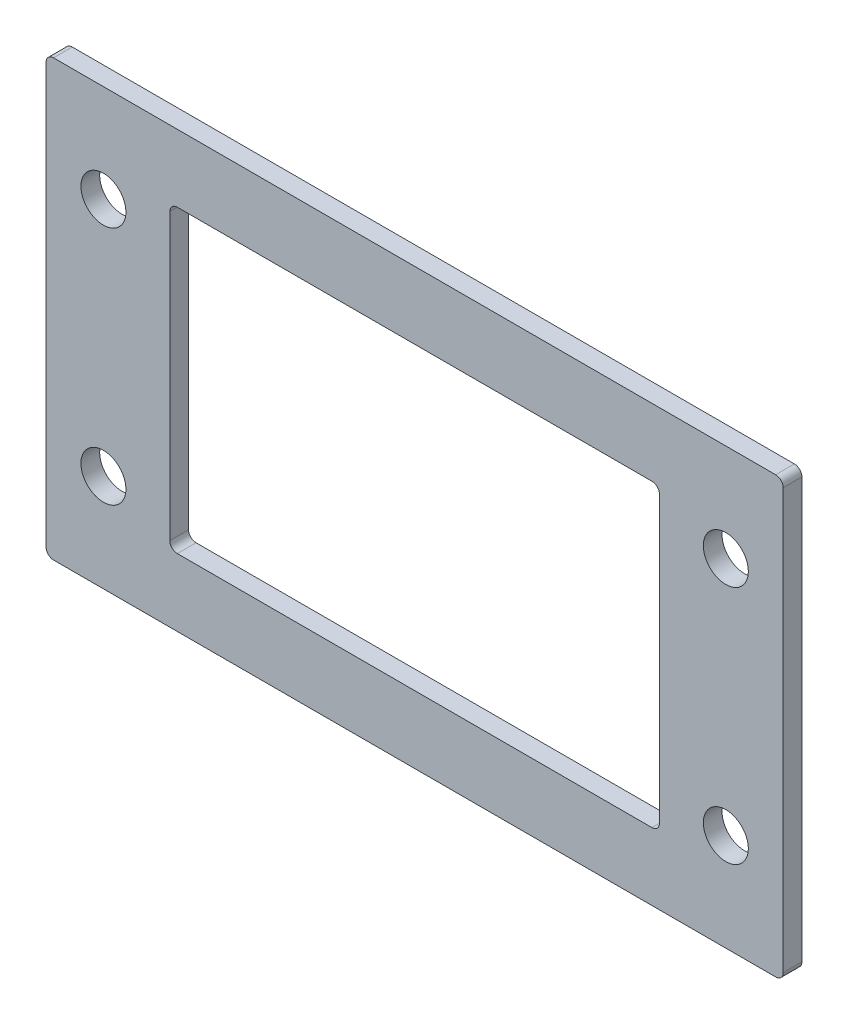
ISO-10303-21;
HEADER;
FILE_DESCRIPTION(('STEP AP214'),'2;1');
FILE_NAME('part.step','',(''),(''),'','','');
FILE_SCHEMA(('AUTOMOTIVE_DESIGN { 1 0 10303 214 1 1 1 1 }'));
ENDSEC;
DATA;
#1=APPLICATION_CONTEXT('core data for automotive mechanical design processes');
#2=APPLICATION_PROTOCOL_DEFINITION('international standard','automotive_design',2000,#1);
#3=PRODUCT_CONTEXT('',#1,'mechanical');
#4=PRODUCT('Part','Part','',(#3));
#5=PRODUCT_RELATED_PRODUCT_CATEGORY('part','',(#4));
#6=PRODUCT_DEFINITION_FORMATION('','',#4);
#7=PRODUCT_DEFINITION_CONTEXT('part definition',#1,'design');
#8=PRODUCT_DEFINITION('design','',#6,#7);
#9=PRODUCT_DEFINITION_SHAPE('','',#8);
#10=(LENGTH_UNIT() NAMED_UNIT(*) SI_UNIT(.MILLI.,.METRE.));
#11=(NAMED_UNIT(*) PLANE_ANGLE_UNIT() SI_UNIT($,.RADIAN.));
#12=(NAMED_UNIT(*) SI_UNIT($,.STERADIAN.) SOLID_ANGLE_UNIT());
#13=UNCERTAINTY_MEASURE_WITH_UNIT(LENGTH_MEASURE(1.E-05),#10,'distance_accuracy_value','');
#14=(GEOMETRIC_REPRESENTATION_CONTEXT(3) GLOBAL_UNCERTAINTY_ASSIGNED_CONTEXT((#13)) GLOBAL_UNIT_ASSIGNED_CONTEXT((#10,
#11,#12)) REPRESENTATION_CONTEXT('',''));
#15=CARTESIAN_POINT('',(0.,0.,0.));
#16=DIRECTION('',(0.,0.,1.));
#17=DIRECTION('',(1.,0.,0.));
#18=AXIS2_PLACEMENT_3D('',#15,#16,#17);
#19=CARTESIAN_POINT('',(-48.15,28.,-17.05));
#20=DIRECTION('',(0.,0.,-1.));
#21=DIRECTION('',(0.,1.,0.));
#22=AXIS2_PLACEMENT_3D('',#19,#20,#21);
#23=CYLINDRICAL_SURFACE('',#22,1.);
#24=CARTESIAN_POINT('',(-48.15,28.,-17.05));
#25=DIRECTION('',(0.,0.,1.));
#26=DIRECTION('',(0.,-1.,0.));
#27=AXIS2_PLACEMENT_3D('',#24,#25,#26);
#28=CIRCLE('',#27,1.);
#29=CARTESIAN_POINT('',(-48.15,29.,-17.05));
#30=VERTEX_POINT('',#29);
#31=CARTESIAN_POINT('',(-49.15,28.,-17.05));
#32=VERTEX_POINT('',#31);
#33=EDGE_CURVE('E393',#30,#32,#28,.T.);
#34=ORIENTED_EDGE('',*,*,#33,.F.);
#35=DIRECTION('',(0.,0.,1.));
#36=VECTOR('',#35,1.);
#37=CARTESIAN_POINT('',(-48.15,29.,-17.05));
#38=LINE('',#37,#36);
#39=CARTESIAN_POINT('',(-48.15,29.,-19.55));
#40=VERTEX_POINT('',#39);
#41=EDGE_CURVE('E248',#40,#30,#38,.T.);
#42=ORIENTED_EDGE('',*,*,#41,.F.);
#43=CARTESIAN_POINT('',(-48.15,28.,-19.55));
#44=DIRECTION('',(0.,0.,-1.));
#45=DIRECTION('',(0.,-1.,0.));
#46=AXIS2_PLACEMENT_3D('',#43,#44,#45);
#47=CIRCLE('',#46,1.);
#48=CARTESIAN_POINT('',(-49.15,28.,-19.55));
#49=VERTEX_POINT('',#48);
#50=EDGE_CURVE('E307',#49,#40,#47,.T.);
#51=ORIENTED_EDGE('',*,*,#50,.F.);
#52=DIRECTION('',(0.,0.,-1.));
#53=VECTOR('',#52,1.);
#54=CARTESIAN_POINT('',(-49.15,28.,-17.05));
#55=LINE('',#54,#53);
#56=EDGE_CURVE('E234',#32,#49,#55,.T.);
#57=ORIENTED_EDGE('',*,*,#56,.F.);
#58=EDGE_LOOP('',(#34,#42,#51,#57));
#59=FACE_BOUND('',#58,.T.);
#60=ADVANCED_FACE('F15',(#59),#23,.T.);
#61=CARTESIAN_POINT('',(-48.15,-28.,-17.05));
#62=DIRECTION('',(0.,0.,-1.));
#63=DIRECTION('',(0.,1.,0.));
#64=AXIS2_PLACEMENT_3D('',#61,#62,#63);
#65=CYLINDRICAL_SURFACE('',#64,1.);
#66=CARTESIAN_POINT('',(-48.15,-28.,-17.05));
#67=DIRECTION('',(0.,0.,1.));
#68=DIRECTION('',(0.,-1.,0.));
#69=AXIS2_PLACEMENT_3D('',#66,#67,#68);
#70=CIRCLE('',#69,1.);
#71=CARTESIAN_POINT('',(-49.15,-28.,-17.05));
#72=VERTEX_POINT('',#71);
#73=CARTESIAN_POINT('',(-48.15,-29.,-17.05));
#74=VERTEX_POINT('',#73);
#75=EDGE_CURVE('E407',#72,#74,#70,.T.);
#76=ORIENTED_EDGE('',*,*,#75,.F.);
#77=DIRECTION('',(0.,0.,1.));
#78=VECTOR('',#77,1.);
#79=CARTESIAN_POINT('',(-49.15,-28.,-17.05));
#80=LINE('',#79,#78);
#81=CARTESIAN_POINT('',(-49.15,-28.,-19.55));
#82=VERTEX_POINT('',#81);
#83=EDGE_CURVE('E212',#82,#72,#80,.T.);
#84=ORIENTED_EDGE('',*,*,#83,.F.);
#85=CARTESIAN_POINT('',(-48.15,-28.,-19.55));
#86=DIRECTION('',(0.,0.,-1.));
#87=DIRECTION('',(0.,-1.,0.));
#88=AXIS2_PLACEMENT_3D('',#85,#86,#87);
#89=CIRCLE('',#88,1.);
#90=CARTESIAN_POINT('',(-48.15,-29.,-19.55));
#91=VERTEX_POINT('',#90);
#92=EDGE_CURVE('E299',#91,#82,#89,.T.);
#93=ORIENTED_EDGE('',*,*,#92,.F.);
#94=DIRECTION('',(0.,0.,-1.));
#95=VECTOR('',#94,1.);
#96=CARTESIAN_POINT('',(-48.15,-29.,-17.05));
#97=LINE('',#96,#95);
#98=EDGE_CURVE('E240',#74,#91,#97,.T.);
#99=ORIENTED_EDGE('',*,*,#98,.F.);
#100=EDGE_LOOP('',(#76,#84,#93,#99));
#101=FACE_BOUND('',#100,.T.);
#102=ADVANCED_FACE('F475',(#101),#65,.T.);
#103=CARTESIAN_POINT('',(48.15,28.,-17.05));
#104=DIRECTION('',(0.,0.,-1.));
#105=DIRECTION('',(0.,1.,0.));
#106=AXIS2_PLACEMENT_3D('',#103,#104,#105);
#107=CYLINDRICAL_SURFACE('',#106,1.);
#108=CARTESIAN_POINT('',(48.15,28.,-17.05));
#109=DIRECTION('',(0.,0.,1.));
#110=DIRECTION('',(0.,-1.,0.));
#111=AXIS2_PLACEMENT_3D('',#108,#109,#110);
#112=CIRCLE('',#111,1.);
#113=CARTESIAN_POINT('',(49.15,28.,-17.05));
#114=VERTEX_POINT('',#113);
#115=CARTESIAN_POINT('',(48.15,29.,-17.05));
#116=VERTEX_POINT('',#115);
#117=EDGE_CURVE('E411',#114,#116,#112,.T.);
#118=ORIENTED_EDGE('',*,*,#117,.F.);
#119=DIRECTION('',(0.,0.,1.));
#120=VECTOR('',#119,1.);
#121=CARTESIAN_POINT('',(49.15,28.,-17.05));
#122=LINE('',#121,#120);
#123=CARTESIAN_POINT('',(49.15,28.,-19.55));
#124=VERTEX_POINT('',#123);
#125=EDGE_CURVE('E244',#124,#114,#122,.T.);
#126=ORIENTED_EDGE('',*,*,#125,.F.);
#127=CARTESIAN_POINT('',(48.15,28.,-19.55));
#128=DIRECTION('',(0.,0.,-1.));
#129=DIRECTION('',(0.,-1.,0.));
#130=AXIS2_PLACEMENT_3D('',#127,#128,#129);
#131=CIRCLE('',#130,1.);
#132=CARTESIAN_POINT('',(48.15,29.,-19.55));
#133=VERTEX_POINT('',#132);
#134=EDGE_CURVE('E315',#133,#124,#131,.T.);
#135=ORIENTED_EDGE('',*,*,#134,.F.);
#136=DIRECTION('',(0.,0.,-1.));
#137=VECTOR('',#136,1.);
#138=CARTESIAN_POINT('',(48.15,29.,-17.05));
#139=LINE('',#138,#137);
#140=EDGE_CURVE('E247',#116,#133,#139,.T.);
#141=ORIENTED_EDGE('',*,*,#140,.F.);
#142=EDGE_LOOP('',(#118,#126,#135,#141));
#143=FACE_BOUND('',#142,.T.);
#144=ADVANCED_FACE('F479',(#143),#107,.T.);
#145=CARTESIAN_POINT('',(48.15,-28.,-17.05));
#146=DIRECTION('',(0.,0.,-1.));
#147=DIRECTION('',(0.,1.,0.));
#148=AXIS2_PLACEMENT_3D('',#145,#146,#147);
#149=CYLINDRICAL_SURFACE('',#148,1.);
#150=CARTESIAN_POINT('',(48.15,-28.,-17.05));
#151=DIRECTION('',(0.,0.,1.));
#152=DIRECTION('',(0.,-1.,0.));
#153=AXIS2_PLACEMENT_3D('',#150,#151,#152);
#154=CIRCLE('',#153,1.);
#155=CARTESIAN_POINT('',(48.15,-29.,-17.05));
#156=VERTEX_POINT('',#155);
#157=CARTESIAN_POINT('',(49.15,-28.,-17.05));
#158=VERTEX_POINT('',#157);
#159=EDGE_CURVE('E398',#156,#158,#154,.T.);
#160=ORIENTED_EDGE('',*,*,#159,.F.);
#161=DIRECTION('',(0.,0.,1.));
#162=VECTOR('',#161,1.);
#163=CARTESIAN_POINT('',(48.15,-29.,-17.05));
#164=LINE('',#163,#162);
#165=CARTESIAN_POINT('',(48.15,-29.,-19.55));
#166=VERTEX_POINT('',#165);
#167=EDGE_CURVE('E237',#166,#156,#164,.T.);
#168=ORIENTED_EDGE('',*,*,#167,.F.);
#169=CARTESIAN_POINT('',(48.15,-28.,-19.55));
#170=DIRECTION('',(0.,0.,-1.));
#171=DIRECTION('',(0.,-1.,0.));
#172=AXIS2_PLACEMENT_3D('',#169,#170,#171);
#173=CIRCLE('',#172,1.);
#174=CARTESIAN_POINT('',(49.15,-28.,-19.55));
#175=VERTEX_POINT('',#174);
#176=EDGE_CURVE('E291',#175,#166,#173,.T.);
#177=ORIENTED_EDGE('',*,*,#176,.F.);
#178=DIRECTION('',(0.,0.,-1.));
#179=VECTOR('',#178,1.);
#180=CARTESIAN_POINT('',(49.15,-28.,-17.05));
#181=LINE('',#180,#179);
#182=EDGE_CURVE('E243',#158,#175,#181,.T.);
#183=ORIENTED_EDGE('',*,*,#182,.F.);
#184=EDGE_LOOP('',(#160,#168,#177,#183));
#185=FACE_BOUND('',#184,.T.);
#186=ADVANCED_FACE('F483',(#185),#149,.T.);
#187=CARTESIAN_POINT('',(-31.65,19.,-17.05));
#188=DIRECTION('',(0.,0.,1.));
#189=DIRECTION('',(0.,-1.,0.));
#190=AXIS2_PLACEMENT_3D('',#187,#188,#189);
#191=CYLINDRICAL_SURFACE('',#190,1.);
#192=CARTESIAN_POINT('',(-31.65,19.,-17.05));
#193=DIRECTION('',(0.,0.,-1.));
#194=DIRECTION('',(0.,-1.,0.));
#195=AXIS2_PLACEMENT_3D('',#192,#193,#194);
#196=CIRCLE('',#195,1.);
#197=CARTESIAN_POINT('',(-32.65,19.,-17.05));
#198=VERTEX_POINT('',#197);
#199=CARTESIAN_POINT('',(-31.65,20.,-17.05));
#200=VERTEX_POINT('',#199);
#201=EDGE_CURVE('E363',#198,#200,#196,.T.);
#202=ORIENTED_EDGE('',*,*,#201,.F.);
#203=DIRECTION('',(0.,0.,1.));
#204=VECTOR('',#203,1.);
#205=CARTESIAN_POINT('',(-32.65,19.,-17.05));
#206=LINE('',#205,#204);
#207=CARTESIAN_POINT('',(-32.65,19.,-19.55));
#208=VERTEX_POINT('',#207);
#209=EDGE_CURVE('E252',#208,#198,#206,.T.);
#210=ORIENTED_EDGE('',*,*,#209,.F.);
#211=CARTESIAN_POINT('',(-31.65,19.,-19.55));
#212=DIRECTION('',(0.,0.,1.));
#213=DIRECTION('',(0.,-1.,0.));
#214=AXIS2_PLACEMENT_3D('',#211,#212,#213);
#215=CIRCLE('',#214,1.);
#216=CARTESIAN_POINT('',(-31.65,20.,-19.55));
#217=VERTEX_POINT('',#216);
#218=EDGE_CURVE('E217',#217,#208,#215,.T.);
#219=ORIENTED_EDGE('',*,*,#218,.F.);
#220=DIRECTION('',(0.,0.,-1.));
#221=VECTOR('',#220,1.);
#222=CARTESIAN_POINT('',(-31.65,20.,-19.55));
#223=LINE('',#222,#221);
#224=EDGE_CURVE('E10',#200,#217,#223,.T.);
#225=ORIENTED_EDGE('',*,*,#224,.F.);
#226=EDGE_LOOP('',(#202,#210,#219,#225));
#227=FACE_BOUND('',#226,.T.);
#228=ADVANCED_FACE('F374',(#227),#191,.F.);
#229=CARTESIAN_POINT('',(-31.65,-19.,-17.05));
#230=DIRECTION('',(0.,0.,1.));
#231=DIRECTION('',(0.,-1.,0.));
#232=AXIS2_PLACEMENT_3D('',#229,#230,#231);
#233=CYLINDRICAL_SURFACE('',#232,1.);
#234=CARTESIAN_POINT('',(-31.65,-19.,-17.05));
#235=DIRECTION('',(0.,0.,-1.));
#236=DIRECTION('',(0.,-1.,0.));
#237=AXIS2_PLACEMENT_3D('',#234,#235,#236);
#238=CIRCLE('',#237,1.);
#239=CARTESIAN_POINT('',(-31.65,-20.,-17.05));
#240=VERTEX_POINT('',#239);
#241=CARTESIAN_POINT('',(-32.65,-19.,-17.05));
#242=VERTEX_POINT('',#241);
#243=EDGE_CURVE('E354',#240,#242,#238,.T.);
#244=ORIENTED_EDGE('',*,*,#243,.F.);
#245=DIRECTION('',(0.,0.,1.));
#246=VECTOR('',#245,1.);
#247=CARTESIAN_POINT('',(-31.65,-20.,-17.05));
#248=LINE('',#247,#246);
#249=CARTESIAN_POINT('',(-31.65,-20.,-19.55));
#250=VERTEX_POINT('',#249);
#251=EDGE_CURVE('E258',#250,#240,#248,.T.);
#252=ORIENTED_EDGE('',*,*,#251,.F.);
#253=CARTESIAN_POINT('',(-31.65,-19.,-19.55));
#254=DIRECTION('',(0.,0.,1.));
#255=DIRECTION('',(0.,-1.,0.));
#256=AXIS2_PLACEMENT_3D('',#253,#254,#255);
#257=CIRCLE('',#256,1.);
#258=CARTESIAN_POINT('',(-32.65,-19.,-19.55));
#259=VERTEX_POINT('',#258);
#260=EDGE_CURVE('E380',#259,#250,#257,.T.);
#261=ORIENTED_EDGE('',*,*,#260,.F.);
#262=DIRECTION('',(0.,0.,-1.));
#263=VECTOR('',#262,1.);
#264=CARTESIAN_POINT('',(-32.65,-19.,-19.55));
#265=LINE('',#264,#263);
#266=EDGE_CURVE('E251',#242,#259,#265,.T.);
#267=ORIENTED_EDGE('',*,*,#266,.F.);
#268=EDGE_LOOP('',(#244,#252,#261,#267));
#269=FACE_BOUND('',#268,.T.);
#270=ADVANCED_FACE('F460',(#269),#233,.F.);
#271=CARTESIAN_POINT('',(31.65,-19.,-17.05));
#272=DIRECTION('',(0.,0.,1.));
#273=DIRECTION('',(0.,-1.,0.));
#274=AXIS2_PLACEMENT_3D('',#271,#272,#273);
#275=CYLINDRICAL_SURFACE('',#274,1.);
#276=CARTESIAN_POINT('',(31.65,-19.,-17.05));
#277=DIRECTION('',(0.,0.,-1.));
#278=DIRECTION('',(0.,-1.,0.));
#279=AXIS2_PLACEMENT_3D('',#276,#277,#278);
#280=CIRCLE('',#279,1.);
#281=CARTESIAN_POINT('',(32.65,-19.,-17.05));
#282=VERTEX_POINT('',#281);
#283=CARTESIAN_POINT('',(31.65,-20.,-17.05));
#284=VERTEX_POINT('',#283);
#285=EDGE_CURVE('E269',#282,#284,#280,.T.);
#286=ORIENTED_EDGE('',*,*,#285,.F.);
#287=DIRECTION('',(0.,0.,1.));
#288=VECTOR('',#287,1.);
#289=CARTESIAN_POINT('',(32.65,-19.,-17.05));
#290=LINE('',#289,#288);
#291=CARTESIAN_POINT('',(32.65,-19.,-19.55));
#292=VERTEX_POINT('',#291);
#293=EDGE_CURVE('E47',#292,#282,#290,.T.);
#294=ORIENTED_EDGE('',*,*,#293,.F.);
#295=CARTESIAN_POINT('',(31.65,-19.,-19.55));
#296=DIRECTION('',(0.,0.,1.));
#297=DIRECTION('',(0.,-1.,0.));
#298=AXIS2_PLACEMENT_3D('',#295,#296,#297);
#299=CIRCLE('',#298,1.);
#300=CARTESIAN_POINT('',(31.65,-20.,-19.55));
#301=VERTEX_POINT('',#300);
#302=EDGE_CURVE('E230',#301,#292,#299,.T.);
#303=ORIENTED_EDGE('',*,*,#302,.F.);
#304=DIRECTION('',(0.,0.,-1.));
#305=VECTOR('',#304,1.);
#306=CARTESIAN_POINT('',(31.65,-20.,-19.55));
#307=LINE('',#306,#305);
#308=EDGE_CURVE('E255',#284,#301,#307,.T.);
#309=ORIENTED_EDGE('',*,*,#308,.F.);
#310=EDGE_LOOP('',(#286,#294,#303,#309));
#311=FACE_BOUND('',#310,.T.);
#312=ADVANCED_FACE('F270',(#311),#275,.F.);
#313=CARTESIAN_POINT('',(31.65,19.,-17.05));
#314=DIRECTION('',(0.,0.,1.));
#315=DIRECTION('',(0.,-1.,0.));
#316=AXIS2_PLACEMENT_3D('',#313,#314,#315);
#317=CYLINDRICAL_SURFACE('',#316,1.);
#318=CARTESIAN_POINT('',(31.65,19.,-17.05));
#319=DIRECTION('',(0.,0.,-1.));
#320=DIRECTION('',(0.,-1.,0.));
#321=AXIS2_PLACEMENT_3D('',#318,#319,#320);
#322=CIRCLE('',#321,1.);
#323=CARTESIAN_POINT('',(31.65,20.,-17.05));
#324=VERTEX_POINT('',#323);
#325=CARTESIAN_POINT('',(32.65,19.,-17.05));
#326=VERTEX_POINT('',#325);
#327=EDGE_CURVE('E197',#324,#326,#322,.T.);
#328=ORIENTED_EDGE('',*,*,#327,.F.);
#329=DIRECTION('',(0.,0.,1.));
#330=VECTOR('',#329,1.);
#331=CARTESIAN_POINT('',(31.65,20.,-17.05));
#332=LINE('',#331,#330);
#333=CARTESIAN_POINT('',(31.65,20.,-19.55));
#334=VERTEX_POINT('',#333);
#335=EDGE_CURVE('E23',#334,#324,#332,.T.);
#336=ORIENTED_EDGE('',*,*,#335,.F.);
#337=CARTESIAN_POINT('',(31.65,19.,-19.55));
#338=DIRECTION('',(0.,0.,1.));
#339=DIRECTION('',(0.,-1.,0.));
#340=AXIS2_PLACEMENT_3D('',#337,#338,#339);
#341=CIRCLE('',#340,1.);
#342=CARTESIAN_POINT('',(32.65,19.,-19.55));
#343=VERTEX_POINT('',#342);
#344=EDGE_CURVE('E194',#343,#334,#341,.T.);
#345=ORIENTED_EDGE('',*,*,#344,.F.);
#346=DIRECTION('',(0.,0.,-1.));
#347=VECTOR('',#346,1.);
#348=CARTESIAN_POINT('',(32.65,19.,-19.55));
#349=LINE('',#348,#347);
#350=EDGE_CURVE('E34',#326,#343,#349,.T.);
#351=ORIENTED_EDGE('',*,*,#350,.F.);
#352=EDGE_LOOP('',(#328,#336,#345,#351));
#353=FACE_BOUND('',#352,.T.);
#354=ADVANCED_FACE('F193',(#353),#317,.F.);
#355=CARTESIAN_POINT('',(-41.5,16.,-17.05));
#356=DIRECTION('',(0.,0.,1.));
#357=DIRECTION('',(0.,-1.,0.));
#358=AXIS2_PLACEMENT_3D('',#355,#356,#357);
#359=CYLINDRICAL_SURFACE('',#358,3.);
#360=CARTESIAN_POINT('',(-41.5,16.,-19.55));
#361=DIRECTION('',(0.,0.,1.));
#362=DIRECTION('',(0.,-1.,0.));
#363=AXIS2_PLACEMENT_3D('',#360,#361,#362);
#364=CIRCLE('',#363,3.);
#365=CARTESIAN_POINT('',(-41.5,13.,-19.55));
#366=VERTEX_POINT('',#365);
#367=EDGE_CURVE('E319',#366,#366,#364,.T.);
#368=ORIENTED_EDGE('',*,*,#367,.F.);
#369=EDGE_LOOP('',(#368));
#370=FACE_BOUND('',#369,.T.);
#371=CARTESIAN_POINT('',(-41.5,16.,-17.05));
#372=DIRECTION('',(0.,0.,1.));
#373=DIRECTION('',(0.,-1.,0.));
#374=AXIS2_PLACEMENT_3D('',#371,#372,#373);
#375=CIRCLE('',#374,3.);
#376=CARTESIAN_POINT('',(-41.5,13.,-17.05));
#377=VERTEX_POINT('',#376);
#378=EDGE_CURVE('E350',#377,#377,#375,.T.);
#379=ORIENTED_EDGE('',*,*,#378,.T.);
#380=EDGE_LOOP('',(#379));
#381=FACE_BOUND('',#380,.T.);
#382=ADVANCED_FACE('F498',(#370,#381),#359,.F.);
#383=CARTESIAN_POINT('',(-41.5,-16.,-17.05));
#384=DIRECTION('',(0.,0.,1.));
#385=DIRECTION('',(0.,-1.,0.));
#386=AXIS2_PLACEMENT_3D('',#383,#384,#385);
#387=CYLINDRICAL_SURFACE('',#386,3.);
#388=CARTESIAN_POINT('',(-41.5,-16.,-19.55));
#389=DIRECTION('',(0.,0.,1.));
#390=DIRECTION('',(0.,-1.,0.));
#391=AXIS2_PLACEMENT_3D('',#388,#389,#390);
#392=CIRCLE('',#391,3.);
#393=CARTESIAN_POINT('',(-41.5,-19.,-19.55));
#394=VERTEX_POINT('',#393);
#395=EDGE_CURVE('E322',#394,#394,#392,.T.);
#396=ORIENTED_EDGE('',*,*,#395,.F.);
#397=EDGE_LOOP('',(#396));
#398=FACE_BOUND('',#397,.T.);
#399=CARTESIAN_POINT('',(-41.5,-16.,-17.05));
#400=DIRECTION('',(0.,0.,1.));
#401=DIRECTION('',(0.,-1.,0.));
#402=AXIS2_PLACEMENT_3D('',#399,#400,#401);
#403=CIRCLE('',#402,3.);
#404=CARTESIAN_POINT('',(-41.5,-19.,-17.05));
#405=VERTEX_POINT('',#404);
#406=EDGE_CURVE('E341',#405,#405,#403,.T.);
#407=ORIENTED_EDGE('',*,*,#406,.T.);
#408=EDGE_LOOP('',(#407));
#409=FACE_BOUND('',#408,.T.);
#410=ADVANCED_FACE('F334',(#398,#409),#387,.F.);
#411=CARTESIAN_POINT('',(41.5,-16.,-17.05));
#412=DIRECTION('',(0.,0.,1.));
#413=DIRECTION('',(0.,-1.,0.));
#414=AXIS2_PLACEMENT_3D('',#411,#412,#413);
#415=CYLINDRICAL_SURFACE('',#414,3.);
#416=CARTESIAN_POINT('',(41.5,-16.,-19.55));
#417=DIRECTION('',(0.,0.,1.));
#418=DIRECTION('',(0.,-1.,0.));
#419=AXIS2_PLACEMENT_3D('',#416,#417,#418);
#420=CIRCLE('',#419,3.);
#421=CARTESIAN_POINT('',(41.5,-19.,-19.55));
#422=VERTEX_POINT('',#421);
#423=EDGE_CURVE('E226',#422,#422,#420,.T.);
#424=ORIENTED_EDGE('',*,*,#423,.F.);
#425=EDGE_LOOP('',(#424));
#426=FACE_BOUND('',#425,.T.);
#427=CARTESIAN_POINT('',(41.5,-16.,-17.05));
#428=DIRECTION('',(0.,0.,1.));
#429=DIRECTION('',(0.,-1.,0.));
#430=AXIS2_PLACEMENT_3D('',#427,#428,#429);
#431=CIRCLE('',#430,3.);
#432=CARTESIAN_POINT('',(41.5,-19.,-17.05));
#433=VERTEX_POINT('',#432);
#434=EDGE_CURVE('E337',#433,#433,#431,.T.);
#435=ORIENTED_EDGE('',*,*,#434,.T.);
#436=EDGE_LOOP('',(#435));
#437=FACE_BOUND('',#436,.T.);
#438=ADVANCED_FACE('F330',(#426,#437),#415,.F.);
#439=CARTESIAN_POINT('',(41.5,16.,-17.05));
#440=DIRECTION('',(0.,0.,1.));
#441=DIRECTION('',(0.,-1.,0.));
#442=AXIS2_PLACEMENT_3D('',#439,#440,#441);
#443=CYLINDRICAL_SURFACE('',#442,3.);
#444=CARTESIAN_POINT('',(41.5,16.,-19.55));
#445=DIRECTION('',(0.,0.,1.));
#446=DIRECTION('',(0.,-1.,0.));
#447=AXIS2_PLACEMENT_3D('',#444,#445,#446);
#448=CIRCLE('',#447,3.);
#449=CARTESIAN_POINT('',(41.5,13.,-19.55));
#450=VERTEX_POINT('',#449);
#451=EDGE_CURVE('E218',#450,#450,#448,.T.);
#452=ORIENTED_EDGE('',*,*,#451,.F.);
#453=EDGE_LOOP('',(#452));
#454=FACE_BOUND('',#453,.T.);
#455=CARTESIAN_POINT('',(41.5,16.,-17.05));
#456=DIRECTION('',(0.,0.,1.));
#457=DIRECTION('',(0.,-1.,0.));
#458=AXIS2_PLACEMENT_3D('',#455,#456,#457);
#459=CIRCLE('',#458,3.);
#460=CARTESIAN_POINT('',(41.5,13.,-17.05));
#461=VERTEX_POINT('',#460);
#462=EDGE_CURVE('E340',#461,#461,#459,.T.);
#463=ORIENTED_EDGE('',*,*,#462,.T.);
#464=EDGE_LOOP('',(#463));
#465=FACE_BOUND('',#464,.T.);
#466=ADVANCED_FACE('F333',(#454,#465),#443,.F.);
#467=CARTESIAN_POINT('',(-32.65,20.,-17.05));
#468=DIRECTION('',(0.,-1.,0.));
#469=DIRECTION('',(1.,0.,0.));
#470=AXIS2_PLACEMENT_3D('',#467,#468,#469);
#471=PLANE('',#470);
#472=DIRECTION('',(-1.,0.,0.));
#473=VECTOR('',#472,1.);
#474=CARTESIAN_POINT('',(-32.65,20.,-19.55));
#475=LINE('',#474,#473);
#476=EDGE_CURVE('E208',#334,#217,#475,.T.);
#477=ORIENTED_EDGE('',*,*,#476,.F.);
#478=ORIENTED_EDGE('',*,*,#335,.T.);
#479=DIRECTION('',(-1.,0.,0.));
#480=VECTOR('',#479,1.);
#481=CARTESIAN_POINT('',(-32.65,20.,-17.05));
#482=LINE('',#481,#480);
#483=EDGE_CURVE('E284',#324,#200,#482,.T.);
#484=ORIENTED_EDGE('',*,*,#483,.T.);
#485=ORIENTED_EDGE('',*,*,#224,.T.);
#486=EDGE_LOOP('',(#477,#478,#484,#485));
#487=FACE_BOUND('',#486,.T.);
#488=ADVANCED_FACE('F214',(#487),#471,.T.);
#489=CARTESIAN_POINT('',(32.65,20.,-17.05));
#490=DIRECTION('',(-1.,0.,0.));
#491=DIRECTION('',(0.,0.,1.));
#492=AXIS2_PLACEMENT_3D('',#489,#490,#491);
#493=PLANE('',#492);
#494=DIRECTION('',(0.,1.,0.));
#495=VECTOR('',#494,1.);
#496=CARTESIAN_POINT('',(32.65,20.,-17.05));
#497=LINE('',#496,#495);
#498=EDGE_CURVE('E267',#282,#326,#497,.T.);
#499=ORIENTED_EDGE('',*,*,#498,.T.);
#500=ORIENTED_EDGE('',*,*,#350,.T.);
#501=DIRECTION('',(0.,1.,0.));
#502=VECTOR('',#501,1.);
#503=CARTESIAN_POINT('',(32.65,20.,-19.55));
#504=LINE('',#503,#502);
#505=EDGE_CURVE('E210',#292,#343,#504,.T.);
#506=ORIENTED_EDGE('',*,*,#505,.F.);
#507=ORIENTED_EDGE('',*,*,#293,.T.);
#508=EDGE_LOOP('',(#499,#500,#506,#507));
#509=FACE_BOUND('',#508,.T.);
#510=ADVANCED_FACE('F265',(#509),#493,.T.);
#511=CARTESIAN_POINT('',(-32.65,-20.,-17.05));
#512=DIRECTION('',(0.,1.,0.));
#513=DIRECTION('',(0.,0.,-1.));
#514=AXIS2_PLACEMENT_3D('',#511,#512,#513);
#515=PLANE('',#514);
#516=DIRECTION('',(1.,0.,0.));
#517=VECTOR('',#516,1.);
#518=CARTESIAN_POINT('',(-32.65,-20.,-17.05));
#519=LINE('',#518,#517);
#520=EDGE_CURVE('E348',#240,#284,#519,.T.);
#521=ORIENTED_EDGE('',*,*,#520,.T.);
#522=ORIENTED_EDGE('',*,*,#308,.T.);
#523=DIRECTION('',(1.,0.,0.));
#524=VECTOR('',#523,1.);
#525=CARTESIAN_POINT('',(-32.65,-20.,-19.55));
#526=LINE('',#525,#524);
#527=EDGE_CURVE('E388',#250,#301,#526,.T.);
#528=ORIENTED_EDGE('',*,*,#527,.F.);
#529=ORIENTED_EDGE('',*,*,#251,.T.);
#530=EDGE_LOOP('',(#521,#522,#528,#529));
#531=FACE_BOUND('',#530,.T.);
#532=ADVANCED_FACE('F456',(#531),#515,.T.);
#533=CARTESIAN_POINT('',(-32.65,20.,-17.05));
#534=DIRECTION('',(1.,0.,0.));
#535=DIRECTION('',(0.,1.,0.));
#536=AXIS2_PLACEMENT_3D('',#533,#534,#535);
#537=PLANE('',#536);
#538=DIRECTION('',(0.,-1.,0.));
#539=VECTOR('',#538,1.);
#540=CARTESIAN_POINT('',(-32.65,20.,-17.05));
#541=LINE('',#540,#539);
#542=EDGE_CURVE('E357',#198,#242,#541,.T.);
#543=ORIENTED_EDGE('',*,*,#542,.T.);
#544=ORIENTED_EDGE('',*,*,#266,.T.);
#545=DIRECTION('',(0.,-1.,0.));
#546=VECTOR('',#545,1.);
#547=CARTESIAN_POINT('',(-32.65,20.,-19.55));
#548=LINE('',#547,#546);
#549=EDGE_CURVE('E224',#208,#259,#548,.T.);
#550=ORIENTED_EDGE('',*,*,#549,.F.);
#551=ORIENTED_EDGE('',*,*,#209,.T.);
#552=EDGE_LOOP('',(#543,#544,#550,#551));
#553=FACE_BOUND('',#552,.T.);
#554=ADVANCED_FACE('F461',(#553),#537,.T.);
#555=CARTESIAN_POINT('',(-49.15,29.,-17.05));
#556=DIRECTION('',(0.,-1.,0.));
#557=DIRECTION('',(1.,0.,0.));
#558=AXIS2_PLACEMENT_3D('',#555,#556,#557);
#559=PLANE('',#558);
#560=DIRECTION('',(-1.,0.,0.));
#561=VECTOR('',#560,1.);
#562=CARTESIAN_POINT('',(-49.15,29.,-17.05));
#563=LINE('',#562,#561);
#564=EDGE_CURVE('E397',#116,#30,#563,.T.);
#565=ORIENTED_EDGE('',*,*,#564,.F.);
#566=ORIENTED_EDGE('',*,*,#140,.T.);
#567=DIRECTION('',(-1.,0.,0.));
#568=VECTOR('',#567,1.);
#569=CARTESIAN_POINT('',(-49.15,29.,-19.55));
#570=LINE('',#569,#568);
#571=EDGE_CURVE('E311',#133,#40,#570,.T.);
#572=ORIENTED_EDGE('',*,*,#571,.T.);
#573=ORIENTED_EDGE('',*,*,#41,.T.);
#574=EDGE_LOOP('',(#565,#566,#572,#573));
#575=FACE_BOUND('',#574,.T.);
#576=ADVANCED_FACE('F432',(#575),#559,.F.);
#577=CARTESIAN_POINT('',(49.15,29.,-17.05));
#578=DIRECTION('',(-1.,0.,0.));
#579=DIRECTION('',(0.,-1.,0.));
#580=AXIS2_PLACEMENT_3D('',#577,#578,#579);
#581=PLANE('',#580);
#582=DIRECTION('',(0.,1.,0.));
#583=VECTOR('',#582,1.);
#584=CARTESIAN_POINT('',(49.15,29.,-17.05));
#585=LINE('',#584,#583);
#586=EDGE_CURVE('E401',#158,#114,#585,.T.);
#587=ORIENTED_EDGE('',*,*,#586,.F.);
#588=ORIENTED_EDGE('',*,*,#182,.T.);
#589=DIRECTION('',(0.,1.,0.));
#590=VECTOR('',#589,1.);
#591=CARTESIAN_POINT('',(49.15,29.,-19.55));
#592=LINE('',#591,#590);
#593=EDGE_CURVE('E275',#175,#124,#592,.T.);
#594=ORIENTED_EDGE('',*,*,#593,.T.);
#595=ORIENTED_EDGE('',*,*,#125,.T.);
#596=EDGE_LOOP('',(#587,#588,#594,#595));
#597=FACE_BOUND('',#596,.T.);
#598=ADVANCED_FACE('F469',(#597),#581,.F.);
#599=CARTESIAN_POINT('',(-49.15,-29.,-17.05));
#600=DIRECTION('',(0.,1.,0.));
#601=DIRECTION('',(0.,0.,-1.));
#602=AXIS2_PLACEMENT_3D('',#599,#600,#601);
#603=PLANE('',#602);
#604=DIRECTION('',(1.,0.,0.));
#605=VECTOR('',#604,1.);
#606=CARTESIAN_POINT('',(-49.15,-29.,-19.55));
#607=LINE('',#606,#605);
#608=EDGE_CURVE('E295',#91,#166,#607,.T.);
#609=ORIENTED_EDGE('',*,*,#608,.T.);
#610=ORIENTED_EDGE('',*,*,#167,.T.);
#611=DIRECTION('',(1.,0.,0.));
#612=VECTOR('',#611,1.);
#613=CARTESIAN_POINT('',(-49.15,-29.,-17.05));
#614=LINE('',#613,#612);
#615=EDGE_CURVE('E402',#74,#156,#614,.T.);
#616=ORIENTED_EDGE('',*,*,#615,.F.);
#617=ORIENTED_EDGE('',*,*,#98,.T.);
#618=EDGE_LOOP('',(#609,#610,#616,#617));
#619=FACE_BOUND('',#618,.T.);
#620=ADVANCED_FACE('F446',(#619),#603,.F.);
#621=CARTESIAN_POINT('',(-49.15,29.,-17.05));
#622=DIRECTION('',(1.,0.,0.));
#623=DIRECTION('',(0.,0.,1.));
#624=AXIS2_PLACEMENT_3D('',#621,#622,#623);
#625=PLANE('',#624);
#626=DIRECTION('',(0.,-1.,0.));
#627=VECTOR('',#626,1.);
#628=CARTESIAN_POINT('',(-49.15,29.,-19.55));
#629=LINE('',#628,#627);
#630=EDGE_CURVE('E303',#49,#82,#629,.T.);
#631=ORIENTED_EDGE('',*,*,#630,.T.);
#632=ORIENTED_EDGE('',*,*,#83,.T.);
#633=DIRECTION('',(0.,-1.,0.));
#634=VECTOR('',#633,1.);
#635=CARTESIAN_POINT('',(-49.15,29.,-17.05));
#636=LINE('',#635,#634);
#637=EDGE_CURVE('E396',#32,#72,#636,.T.);
#638=ORIENTED_EDGE('',*,*,#637,.F.);
#639=ORIENTED_EDGE('',*,*,#56,.T.);
#640=EDGE_LOOP('',(#631,#632,#638,#639));
#641=FACE_BOUND('',#640,.T.);
#642=ADVANCED_FACE('F440',(#641),#625,.F.);
#643=CARTESIAN_POINT('',(-49.15,-29.,-19.55));
#644=DIRECTION('',(0.,0.,1.));
#645=DIRECTION('',(1.,0.,0.));
#646=AXIS2_PLACEMENT_3D('',#643,#644,#645);
#647=PLANE('',#646);
#648=ORIENTED_EDGE('',*,*,#476,.T.);
#649=ORIENTED_EDGE('',*,*,#218,.T.);
#650=ORIENTED_EDGE('',*,*,#549,.T.);
#651=ORIENTED_EDGE('',*,*,#260,.T.);
#652=ORIENTED_EDGE('',*,*,#527,.T.);
#653=ORIENTED_EDGE('',*,*,#302,.T.);
#654=ORIENTED_EDGE('',*,*,#505,.T.);
#655=ORIENTED_EDGE('',*,*,#344,.T.);
#656=EDGE_LOOP('',(#648,#649,#650,#651,#652,#653,#654,#655));
#657=FACE_BOUND('',#656,.T.);
#658=ORIENTED_EDGE('',*,*,#451,.T.);
#659=EDGE_LOOP('',(#658));
#660=FACE_BOUND('',#659,.T.);
#661=ORIENTED_EDGE('',*,*,#423,.T.);
#662=EDGE_LOOP('',(#661));
#663=FACE_BOUND('',#662,.T.);
#664=ORIENTED_EDGE('',*,*,#395,.T.);
#665=EDGE_LOOP('',(#664));
#666=FACE_BOUND('',#665,.T.);
#667=ORIENTED_EDGE('',*,*,#367,.T.);
#668=EDGE_LOOP('',(#667));
#669=FACE_BOUND('',#668,.T.);
#670=ORIENTED_EDGE('',*,*,#593,.F.);
#671=ORIENTED_EDGE('',*,*,#176,.T.);
#672=ORIENTED_EDGE('',*,*,#608,.F.);
#673=ORIENTED_EDGE('',*,*,#92,.T.);
#674=ORIENTED_EDGE('',*,*,#630,.F.);
#675=ORIENTED_EDGE('',*,*,#50,.T.);
#676=ORIENTED_EDGE('',*,*,#571,.F.);
#677=ORIENTED_EDGE('',*,*,#134,.T.);
#678=EDGE_LOOP('',(#670,#671,#672,#673,#674,#675,#676,#677));
#679=FACE_BOUND('',#678,.T.);
#680=ADVANCED_FACE('F205',(#657,#660,#663,#666,#669,#679),#647,.F.);
#681=CARTESIAN_POINT('',(-49.15,-29.,-17.05));
#682=DIRECTION('',(0.,0.,1.));
#683=DIRECTION('',(1.,0.,0.));
#684=AXIS2_PLACEMENT_3D('',#681,#682,#683);
#685=PLANE('',#684);
#686=ORIENTED_EDGE('',*,*,#520,.F.);
#687=ORIENTED_EDGE('',*,*,#243,.T.);
#688=ORIENTED_EDGE('',*,*,#542,.F.);
#689=ORIENTED_EDGE('',*,*,#201,.T.);
#690=ORIENTED_EDGE('',*,*,#483,.F.);
#691=ORIENTED_EDGE('',*,*,#327,.T.);
#692=ORIENTED_EDGE('',*,*,#498,.F.);
#693=ORIENTED_EDGE('',*,*,#285,.T.);
#694=EDGE_LOOP('',(#686,#687,#688,#689,#690,#691,#692,#693));
#695=FACE_BOUND('',#694,.T.);
#696=ORIENTED_EDGE('',*,*,#462,.F.);
#697=EDGE_LOOP('',(#696));
#698=FACE_BOUND('',#697,.T.);
#699=ORIENTED_EDGE('',*,*,#434,.F.);
#700=EDGE_LOOP('',(#699));
#701=FACE_BOUND('',#700,.T.);
#702=ORIENTED_EDGE('',*,*,#406,.F.);
#703=EDGE_LOOP('',(#702));
#704=FACE_BOUND('',#703,.T.);
#705=ORIENTED_EDGE('',*,*,#378,.F.);
#706=EDGE_LOOP('',(#705));
#707=FACE_BOUND('',#706,.T.);
#708=ORIENTED_EDGE('',*,*,#615,.T.);
#709=ORIENTED_EDGE('',*,*,#159,.T.);
#710=ORIENTED_EDGE('',*,*,#586,.T.);
#711=ORIENTED_EDGE('',*,*,#117,.T.);
#712=ORIENTED_EDGE('',*,*,#564,.T.);
#713=ORIENTED_EDGE('',*,*,#33,.T.);
#714=ORIENTED_EDGE('',*,*,#637,.T.);
#715=ORIENTED_EDGE('',*,*,#75,.T.);
#716=EDGE_LOOP('',(#708,#709,#710,#711,#712,#713,#714,#715));
#717=FACE_BOUND('',#716,.T.);
#718=ADVANCED_FACE('F277',(#695,#698,#701,#704,#707,#717),#685,.T.);
#719=CLOSED_SHELL('',(#60,#102,#144,#186,#228,#270,#312,#354,#382,#410,#438,#466,#488,#510,#532,
#554,#576,#598,#620,#642,#680,#718));
#720=MANIFOLD_SOLID_BREP('B1',#719);
#721=ADVANCED_BREP_SHAPE_REPRESENTATION('',(#18,#720),#14);
#722=SHAPE_DEFINITION_REPRESENTATION(#9,#721);
ENDSEC;
END-ISO-10303-21;
